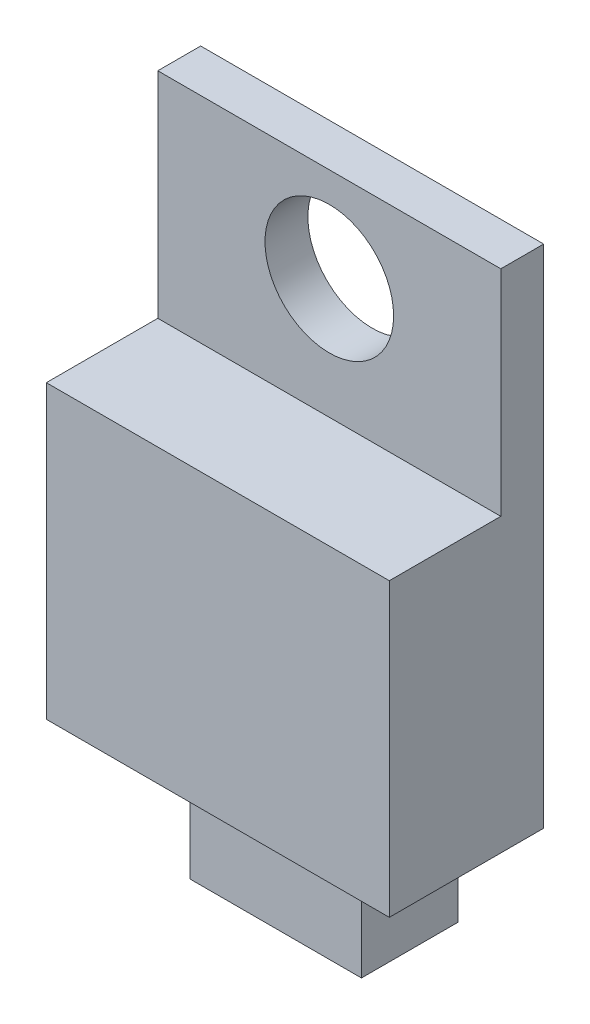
ISO-10303-21;
HEADER;
FILE_DESCRIPTION(('STEP AP214'),'2;1');
FILE_NAME('part.step','',(''),(''),'','','');
FILE_SCHEMA(('AUTOMOTIVE_DESIGN { 1 0 10303 214 1 1 1 1 }'));
ENDSEC;
DATA;
#1=APPLICATION_CONTEXT('core data for automotive mechanical design processes');
#2=APPLICATION_PROTOCOL_DEFINITION('international standard','automotive_design',2000,#1);
#3=PRODUCT_CONTEXT('',#1,'mechanical');
#4=PRODUCT('Part','Part','',(#3));
#5=PRODUCT_RELATED_PRODUCT_CATEGORY('part','',(#4));
#6=PRODUCT_DEFINITION_FORMATION('','',#4);
#7=PRODUCT_DEFINITION_CONTEXT('part definition',#1,'design');
#8=PRODUCT_DEFINITION('design','',#6,#7);
#9=PRODUCT_DEFINITION_SHAPE('','',#8);
#10=(LENGTH_UNIT() NAMED_UNIT(*) SI_UNIT(.MILLI.,.METRE.));
#11=(NAMED_UNIT(*) PLANE_ANGLE_UNIT() SI_UNIT($,.RADIAN.));
#12=(NAMED_UNIT(*) SI_UNIT($,.STERADIAN.) SOLID_ANGLE_UNIT());
#13=UNCERTAINTY_MEASURE_WITH_UNIT(LENGTH_MEASURE(1.E-05),#10,'distance_accuracy_value','');
#14=(GEOMETRIC_REPRESENTATION_CONTEXT(3) GLOBAL_UNCERTAINTY_ASSIGNED_CONTEXT((#13)) GLOBAL_UNIT_ASSIGNED_CONTEXT((#10,
#11,#12)) REPRESENTATION_CONTEXT('',''));
#15=CARTESIAN_POINT('',(0.,0.,0.));
#16=DIRECTION('',(0.,0.,1.));
#17=DIRECTION('',(1.,0.,0.));
#18=AXIS2_PLACEMENT_3D('',#15,#16,#17);
#19=CARTESIAN_POINT('',(0.,0.,1.27));
#20=DIRECTION('',(0.,1.,0.));
#21=DIRECTION('',(0.,0.,1.));
#22=AXIS2_PLACEMENT_3D('',#19,#20,#21);
#23=PLANE('',#22);
#24=DIRECTION('',(0.,0.,-1.));
#25=VECTOR('',#24,1.);
#26=CARTESIAN_POINT('',(2.54,0.,0.));
#27=LINE('',#26,#25);
#28=CARTESIAN_POINT('',(2.54,0.,2.8575));
#29=VERTEX_POINT('',#28);
#30=CARTESIAN_POINT('',(2.54,0.,0.));
#31=VERTEX_POINT('',#30);
#32=EDGE_CURVE('E35',#29,#31,#27,.T.);
#33=ORIENTED_EDGE('',*,*,#32,.F.);
#34=DIRECTION('',(-1.,0.,0.));
#35=VECTOR('',#34,1.);
#36=CARTESIAN_POINT('',(2.54,0.,2.8575));
#37=LINE('',#36,#35);
#38=CARTESIAN_POINT('',(7.62,0.,2.8575));
#39=VERTEX_POINT('',#38);
#40=EDGE_CURVE('E106',#39,#29,#37,.T.);
#41=ORIENTED_EDGE('',*,*,#40,.F.);
#42=DIRECTION('',(0.,0.,1.));
#43=VECTOR('',#42,1.);
#44=CARTESIAN_POINT('',(7.62,0.,0.));
#45=LINE('',#44,#43);
#46=CARTESIAN_POINT('',(7.62,0.,0.));
#47=VERTEX_POINT('',#46);
#48=EDGE_CURVE('E54',#47,#39,#45,.T.);
#49=ORIENTED_EDGE('',*,*,#48,.F.);
#50=DIRECTION('',(1.,0.,0.));
#51=VECTOR('',#50,1.);
#52=CARTESIAN_POINT('',(0.,0.,0.));
#53=LINE('',#52,#51);
#54=CARTESIAN_POINT('',(10.16,0.,0.));
#55=VERTEX_POINT('',#54);
#56=EDGE_CURVE('E160',#47,#55,#53,.T.);
#57=ORIENTED_EDGE('',*,*,#56,.T.);
#58=DIRECTION('',(0.,0.,-1.));
#59=VECTOR('',#58,1.);
#60=CARTESIAN_POINT('',(10.16,0.,1.27));
#61=LINE('',#60,#59);
#62=CARTESIAN_POINT('',(10.16,0.,4.572));
#63=VERTEX_POINT('',#62);
#64=EDGE_CURVE('E41',#63,#55,#61,.T.);
#65=ORIENTED_EDGE('',*,*,#64,.F.);
#66=DIRECTION('',(1.,0.,0.));
#67=VECTOR('',#66,1.);
#68=CARTESIAN_POINT('',(0.,0.,4.572));
#69=LINE('',#68,#67);
#70=CARTESIAN_POINT('',(0.,0.,4.572));
#71=VERTEX_POINT('',#70);
#72=EDGE_CURVE('E209',#71,#63,#69,.T.);
#73=ORIENTED_EDGE('',*,*,#72,.F.);
#74=DIRECTION('',(0.,0.,-1.));
#75=VECTOR('',#74,1.);
#76=CARTESIAN_POINT('',(0.,0.,1.27));
#77=LINE('',#76,#75);
#78=CARTESIAN_POINT('',(0.,0.,0.));
#79=VERTEX_POINT('',#78);
#80=EDGE_CURVE('E11',#71,#79,#77,.T.);
#81=ORIENTED_EDGE('',*,*,#80,.T.);
#82=EDGE_CURVE('E156',#79,#31,#53,.T.);
#83=ORIENTED_EDGE('',*,*,#82,.T.);
#84=EDGE_LOOP('',(#33,#41,#49,#57,#65,#73,#81,#83));
#85=FACE_BOUND('',#84,.T.);
#86=ADVANCED_FACE('F31',(#85),#23,.F.);
#87=CARTESIAN_POINT('',(0.,14.986,1.27));
#88=DIRECTION('',(0.,0.,-1.));
#89=DIRECTION('',(-1.,0.,0.));
#90=AXIS2_PLACEMENT_3D('',#87,#88,#89);
#91=PLANE('',#90);
#92=CARTESIAN_POINT('',(5.08,12.192,1.27));
#93=DIRECTION('',(0.,0.,1.));
#94=DIRECTION('',(1.,0.,0.));
#95=AXIS2_PLACEMENT_3D('',#92,#93,#94);
#96=CIRCLE('',#95,1.905);
#97=CARTESIAN_POINT('',(6.985,12.192,1.27));
#98=VERTEX_POINT('',#97);
#99=EDGE_CURVE('E214',#98,#98,#96,.T.);
#100=ORIENTED_EDGE('',*,*,#99,.F.);
#101=EDGE_LOOP('',(#100));
#102=FACE_BOUND('',#101,.T.);
#103=DIRECTION('',(-1.,0.,0.));
#104=VECTOR('',#103,1.);
#105=CARTESIAN_POINT('',(0.,8.636,1.27));
#106=LINE('',#105,#104);
#107=CARTESIAN_POINT('',(10.16,8.63599999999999,1.27));
#108=VERTEX_POINT('',#107);
#109=CARTESIAN_POINT('',(0.,8.636,1.27));
#110=VERTEX_POINT('',#109);
#111=EDGE_CURVE('E137',#108,#110,#106,.T.);
#112=ORIENTED_EDGE('',*,*,#111,.F.);
#113=DIRECTION('',(0.,1.,0.));
#114=VECTOR('',#113,1.);
#115=CARTESIAN_POINT('',(10.16,0.,1.27));
#116=LINE('',#115,#114);
#117=CARTESIAN_POINT('',(10.16,14.986,1.27));
#118=VERTEX_POINT('',#117);
#119=EDGE_CURVE('E141',#108,#118,#116,.T.);
#120=ORIENTED_EDGE('',*,*,#119,.T.);
#121=DIRECTION('',(-1.,0.,0.));
#122=VECTOR('',#121,1.);
#123=CARTESIAN_POINT('',(0.,14.986,1.27));
#124=LINE('',#123,#122);
#125=CARTESIAN_POINT('',(0.,14.986,1.27));
#126=VERTEX_POINT('',#125);
#127=EDGE_CURVE('E182',#118,#126,#124,.T.);
#128=ORIENTED_EDGE('',*,*,#127,.T.);
#129=DIRECTION('',(0.,-1.,0.));
#130=VECTOR('',#129,1.);
#131=CARTESIAN_POINT('',(0.,0.,1.27));
#132=LINE('',#131,#130);
#133=EDGE_CURVE('E170',#126,#110,#132,.T.);
#134=ORIENTED_EDGE('',*,*,#133,.T.);
#135=EDGE_LOOP('',(#112,#120,#128,#134));
#136=FACE_BOUND('',#135,.T.);
#137=ADVANCED_FACE('F188',(#102,#136),#91,.F.);
#138=CARTESIAN_POINT('',(0.,14.986,0.));
#139=DIRECTION('',(0.,0.,-1.));
#140=DIRECTION('',(-1.,0.,0.));
#141=AXIS2_PLACEMENT_3D('',#138,#139,#140);
#142=PLANE('',#141);
#143=DIRECTION('',(0.,-1.,0.));
#144=VECTOR('',#143,1.);
#145=CARTESIAN_POINT('',(0.,0.,0.));
#146=LINE('',#145,#144);
#147=CARTESIAN_POINT('',(0.,14.986,0.));
#148=VERTEX_POINT('',#147);
#149=EDGE_CURVE('E164',#148,#79,#146,.T.);
#150=ORIENTED_EDGE('',*,*,#149,.F.);
#151=DIRECTION('',(-1.,0.,0.));
#152=VECTOR('',#151,1.);
#153=CARTESIAN_POINT('',(0.,14.986,0.));
#154=LINE('',#153,#152);
#155=CARTESIAN_POINT('',(10.16,14.986,0.));
#156=VERTEX_POINT('',#155);
#157=EDGE_CURVE('E168',#156,#148,#154,.T.);
#158=ORIENTED_EDGE('',*,*,#157,.F.);
#159=DIRECTION('',(0.,1.,0.));
#160=VECTOR('',#159,1.);
#161=CARTESIAN_POINT('',(10.16,0.,0.));
#162=LINE('',#161,#160);
#163=EDGE_CURVE('E159',#55,#156,#162,.T.);
#164=ORIENTED_EDGE('',*,*,#163,.F.);
#165=ORIENTED_EDGE('',*,*,#56,.F.);
#166=DIRECTION('',(0.,1.,0.));
#167=VECTOR('',#166,1.);
#168=CARTESIAN_POINT('',(7.62,-3.683,0.));
#169=LINE('',#168,#167);
#170=CARTESIAN_POINT('',(7.62,-3.683,0.));
#171=VERTEX_POINT('',#170);
#172=EDGE_CURVE('E121',#171,#47,#169,.T.);
#173=ORIENTED_EDGE('',*,*,#172,.F.);
#174=DIRECTION('',(1.,0.,0.));
#175=VECTOR('',#174,1.);
#176=CARTESIAN_POINT('',(2.54,-3.683,0.));
#177=LINE('',#176,#175);
#178=CARTESIAN_POINT('',(2.54,-3.683,0.));
#179=VERTEX_POINT('',#178);
#180=EDGE_CURVE('E321',#179,#171,#177,.T.);
#181=ORIENTED_EDGE('',*,*,#180,.F.);
#182=DIRECTION('',(0.,1.,0.));
#183=VECTOR('',#182,1.);
#184=CARTESIAN_POINT('',(2.54,-3.683,0.));
#185=LINE('',#184,#183);
#186=EDGE_CURVE('E127',#179,#31,#185,.T.);
#187=ORIENTED_EDGE('',*,*,#186,.T.);
#188=ORIENTED_EDGE('',*,*,#82,.F.);
#189=EDGE_LOOP('',(#150,#158,#164,#165,#173,#181,#187,#188));
#190=FACE_BOUND('',#189,.T.);
#191=CARTESIAN_POINT('',(5.08,12.192,0.));
#192=DIRECTION('',(0.,0.,1.));
#193=DIRECTION('',(1.,0.,0.));
#194=AXIS2_PLACEMENT_3D('',#191,#192,#193);
#195=CIRCLE('',#194,1.905);
#196=CARTESIAN_POINT('',(6.985,12.192,0.));
#197=VERTEX_POINT('',#196);
#198=EDGE_CURVE('E153',#197,#197,#195,.T.);
#199=ORIENTED_EDGE('',*,*,#198,.T.);
#200=EDGE_LOOP('',(#199));
#201=FACE_BOUND('',#200,.T.);
#202=ADVANCED_FACE('F220',(#190,#201),#142,.T.);
#203=CARTESIAN_POINT('',(0.,0.,1.27));
#204=DIRECTION('',(1.,0.,0.));
#205=DIRECTION('',(0.,0.,-1.));
#206=AXIS2_PLACEMENT_3D('',#203,#204,#205);
#207=PLANE('',#206);
#208=ORIENTED_EDGE('',*,*,#149,.T.);
#209=ORIENTED_EDGE('',*,*,#80,.F.);
#210=DIRECTION('',(0.,-1.,0.));
#211=VECTOR('',#210,1.);
#212=CARTESIAN_POINT('',(0.,0.,4.572));
#213=LINE('',#212,#211);
#214=CARTESIAN_POINT('',(0.,8.636,4.572));
#215=VERTEX_POINT('',#214);
#216=EDGE_CURVE('E134',#215,#71,#213,.T.);
#217=ORIENTED_EDGE('',*,*,#216,.F.);
#218=DIRECTION('',(0.,0.,-1.));
#219=VECTOR('',#218,1.);
#220=CARTESIAN_POINT('',(0.,8.636,4.572));
#221=LINE('',#220,#219);
#222=EDGE_CURVE('E144',#215,#110,#221,.T.);
#223=ORIENTED_EDGE('',*,*,#222,.T.);
#224=ORIENTED_EDGE('',*,*,#133,.F.);
#225=DIRECTION('',(0.,0.,-1.));
#226=VECTOR('',#225,1.);
#227=CARTESIAN_POINT('',(0.,14.986,1.27));
#228=LINE('',#227,#226);
#229=EDGE_CURVE('E180',#126,#148,#228,.T.);
#230=ORIENTED_EDGE('',*,*,#229,.T.);
#231=EDGE_LOOP('',(#208,#209,#217,#223,#224,#230));
#232=FACE_BOUND('',#231,.T.);
#233=ADVANCED_FACE('F33',(#232),#207,.F.);
#234=CARTESIAN_POINT('',(10.16,0.,1.27));
#235=DIRECTION('',(-1.,0.,0.));
#236=DIRECTION('',(0.,0.,1.));
#237=AXIS2_PLACEMENT_3D('',#234,#235,#236);
#238=PLANE('',#237);
#239=ORIENTED_EDGE('',*,*,#163,.T.);
#240=DIRECTION('',(0.,0.,-1.));
#241=VECTOR('',#240,1.);
#242=CARTESIAN_POINT('',(10.16,14.986,1.27));
#243=LINE('',#242,#241);
#244=EDGE_CURVE('E177',#118,#156,#243,.T.);
#245=ORIENTED_EDGE('',*,*,#244,.F.);
#246=ORIENTED_EDGE('',*,*,#119,.F.);
#247=DIRECTION('',(0.,0.,-1.));
#248=VECTOR('',#247,1.);
#249=CARTESIAN_POINT('',(10.16,8.636,4.572));
#250=LINE('',#249,#248);
#251=CARTESIAN_POINT('',(10.16,8.636,4.572));
#252=VERTEX_POINT('',#251);
#253=EDGE_CURVE('E147',#252,#108,#250,.T.);
#254=ORIENTED_EDGE('',*,*,#253,.F.);
#255=DIRECTION('',(0.,1.,0.));
#256=VECTOR('',#255,1.);
#257=CARTESIAN_POINT('',(10.16,0.,4.572));
#258=LINE('',#257,#256);
#259=EDGE_CURVE('E206',#63,#252,#258,.T.);
#260=ORIENTED_EDGE('',*,*,#259,.F.);
#261=ORIENTED_EDGE('',*,*,#64,.T.);
#262=EDGE_LOOP('',(#239,#245,#246,#254,#260,#261));
#263=FACE_BOUND('',#262,.T.);
#264=ADVANCED_FACE('F191',(#263),#238,.F.);
#265=CARTESIAN_POINT('',(0.,14.986,1.27));
#266=DIRECTION('',(0.,-1.,0.));
#267=DIRECTION('',(0.,0.,-1.));
#268=AXIS2_PLACEMENT_3D('',#265,#266,#267);
#269=PLANE('',#268);
#270=ORIENTED_EDGE('',*,*,#157,.T.);
#271=ORIENTED_EDGE('',*,*,#229,.F.);
#272=ORIENTED_EDGE('',*,*,#127,.F.);
#273=ORIENTED_EDGE('',*,*,#244,.T.);
#274=EDGE_LOOP('',(#270,#271,#272,#273));
#275=FACE_BOUND('',#274,.T.);
#276=ADVANCED_FACE('F195',(#275),#269,.F.);
#277=CARTESIAN_POINT('',(5.08,12.192,1.27));
#278=DIRECTION('',(0.,0.,-1.));
#279=DIRECTION('',(-1.,0.,0.));
#280=AXIS2_PLACEMENT_3D('',#277,#278,#279);
#281=CYLINDRICAL_SURFACE('',#280,1.905);
#282=ORIENTED_EDGE('',*,*,#99,.T.);
#283=EDGE_LOOP('',(#282));
#284=FACE_BOUND('',#283,.T.);
#285=ORIENTED_EDGE('',*,*,#198,.F.);
#286=EDGE_LOOP('',(#285));
#287=FACE_BOUND('',#286,.T.);
#288=ADVANCED_FACE('F235',(#284,#287),#281,.F.);
#289=CARTESIAN_POINT('',(0.,8.636,4.572));
#290=DIRECTION('',(0.,-1.,0.));
#291=DIRECTION('',(0.,0.,-1.));
#292=AXIS2_PLACEMENT_3D('',#289,#290,#291);
#293=PLANE('',#292);
#294=ORIENTED_EDGE('',*,*,#111,.T.);
#295=ORIENTED_EDGE('',*,*,#222,.F.);
#296=DIRECTION('',(-1.,0.,0.));
#297=VECTOR('',#296,1.);
#298=CARTESIAN_POINT('',(0.,8.636,4.572));
#299=LINE('',#298,#297);
#300=EDGE_CURVE('E148',#252,#215,#299,.T.);
#301=ORIENTED_EDGE('',*,*,#300,.F.);
#302=ORIENTED_EDGE('',*,*,#253,.T.);
#303=EDGE_LOOP('',(#294,#295,#301,#302));
#304=FACE_BOUND('',#303,.T.);
#305=ADVANCED_FACE('F203',(#304),#293,.F.);
#306=CARTESIAN_POINT('',(0.,8.636,4.572));
#307=DIRECTION('',(0.,0.,-1.));
#308=DIRECTION('',(-1.,0.,0.));
#309=AXIS2_PLACEMENT_3D('',#306,#307,#308);
#310=PLANE('',#309);
#311=ORIENTED_EDGE('',*,*,#216,.T.);
#312=ORIENTED_EDGE('',*,*,#72,.T.);
#313=ORIENTED_EDGE('',*,*,#259,.T.);
#314=ORIENTED_EDGE('',*,*,#300,.T.);
#315=EDGE_LOOP('',(#311,#312,#313,#314));
#316=FACE_BOUND('',#315,.T.);
#317=ADVANCED_FACE('F225',(#316),#310,.F.);
#318=CARTESIAN_POINT('',(2.54,-3.683,0.));
#319=DIRECTION('',(1.,0.,0.));
#320=DIRECTION('',(0.,0.,-1.));
#321=AXIS2_PLACEMENT_3D('',#318,#319,#320);
#322=PLANE('',#321);
#323=ORIENTED_EDGE('',*,*,#32,.T.);
#324=ORIENTED_EDGE('',*,*,#186,.F.);
#325=DIRECTION('',(0.,0.,-1.));
#326=VECTOR('',#325,1.);
#327=CARTESIAN_POINT('',(2.54,-3.683,0.));
#328=LINE('',#327,#326);
#329=CARTESIAN_POINT('',(2.54,-3.683,2.8575));
#330=VERTEX_POINT('',#329);
#331=EDGE_CURVE('E111',#330,#179,#328,.T.);
#332=ORIENTED_EDGE('',*,*,#331,.F.);
#333=DIRECTION('',(0.,1.,0.));
#334=VECTOR('',#333,1.);
#335=CARTESIAN_POINT('',(2.54,-3.683,2.8575));
#336=LINE('',#335,#334);
#337=EDGE_CURVE('E125',#330,#29,#336,.T.);
#338=ORIENTED_EDGE('',*,*,#337,.T.);
#339=EDGE_LOOP('',(#323,#324,#332,#338));
#340=FACE_BOUND('',#339,.T.);
#341=ADVANCED_FACE('F227',(#340),#322,.F.);
#342=CARTESIAN_POINT('',(7.62,-3.683,0.));
#343=DIRECTION('',(-1.,0.,0.));
#344=DIRECTION('',(0.,0.,1.));
#345=AXIS2_PLACEMENT_3D('',#342,#343,#344);
#346=PLANE('',#345);
#347=ORIENTED_EDGE('',*,*,#48,.T.);
#348=DIRECTION('',(0.,1.,0.));
#349=VECTOR('',#348,1.);
#350=CARTESIAN_POINT('',(7.62,-3.683,2.8575));
#351=LINE('',#350,#349);
#352=CARTESIAN_POINT('',(7.62,-3.683,2.8575));
#353=VERTEX_POINT('',#352);
#354=EDGE_CURVE('E118',#353,#39,#351,.T.);
#355=ORIENTED_EDGE('',*,*,#354,.F.);
#356=DIRECTION('',(0.,0.,1.));
#357=VECTOR('',#356,1.);
#358=CARTESIAN_POINT('',(7.62,-3.683,0.));
#359=LINE('',#358,#357);
#360=EDGE_CURVE('E329',#171,#353,#359,.T.);
#361=ORIENTED_EDGE('',*,*,#360,.F.);
#362=ORIENTED_EDGE('',*,*,#172,.T.);
#363=EDGE_LOOP('',(#347,#355,#361,#362));
#364=FACE_BOUND('',#363,.T.);
#365=ADVANCED_FACE('F116',(#364),#346,.F.);
#366=CARTESIAN_POINT('',(2.54,-3.683,2.8575));
#367=DIRECTION('',(0.,0.,-1.));
#368=DIRECTION('',(-1.,0.,0.));
#369=AXIS2_PLACEMENT_3D('',#366,#367,#368);
#370=PLANE('',#369);
#371=ORIENTED_EDGE('',*,*,#40,.T.);
#372=ORIENTED_EDGE('',*,*,#337,.F.);
#373=DIRECTION('',(-1.,0.,0.));
#374=VECTOR('',#373,1.);
#375=CARTESIAN_POINT('',(2.54,-3.683,2.8575));
#376=LINE('',#375,#374);
#377=EDGE_CURVE('E124',#353,#330,#376,.T.);
#378=ORIENTED_EDGE('',*,*,#377,.F.);
#379=ORIENTED_EDGE('',*,*,#354,.T.);
#380=EDGE_LOOP('',(#371,#372,#378,#379));
#381=FACE_BOUND('',#380,.T.);
#382=ADVANCED_FACE('F123',(#381),#370,.F.);
#383=CARTESIAN_POINT('',(2.54,-3.683,2.8575));
#384=DIRECTION('',(0.,1.,0.));
#385=DIRECTION('',(0.,0.,1.));
#386=AXIS2_PLACEMENT_3D('',#383,#384,#385);
#387=PLANE('',#386);
#388=ORIENTED_EDGE('',*,*,#331,.T.);
#389=ORIENTED_EDGE('',*,*,#180,.T.);
#390=ORIENTED_EDGE('',*,*,#360,.T.);
#391=ORIENTED_EDGE('',*,*,#377,.T.);
#392=EDGE_LOOP('',(#388,#389,#390,#391));
#393=FACE_BOUND('',#392,.T.);
#394=ADVANCED_FACE('F306',(#393),#387,.F.);
#395=CLOSED_SHELL('',(#86,#137,#202,#233,#264,#276,#288,#305,#317,#341,#365,#382,#394));
#396=MANIFOLD_SOLID_BREP('B2',#395);
#397=ADVANCED_BREP_SHAPE_REPRESENTATION('',(#18,#396),#14);
#398=SHAPE_DEFINITION_REPRESENTATION(#9,#397);
ENDSEC;
END-ISO-10303-21;
